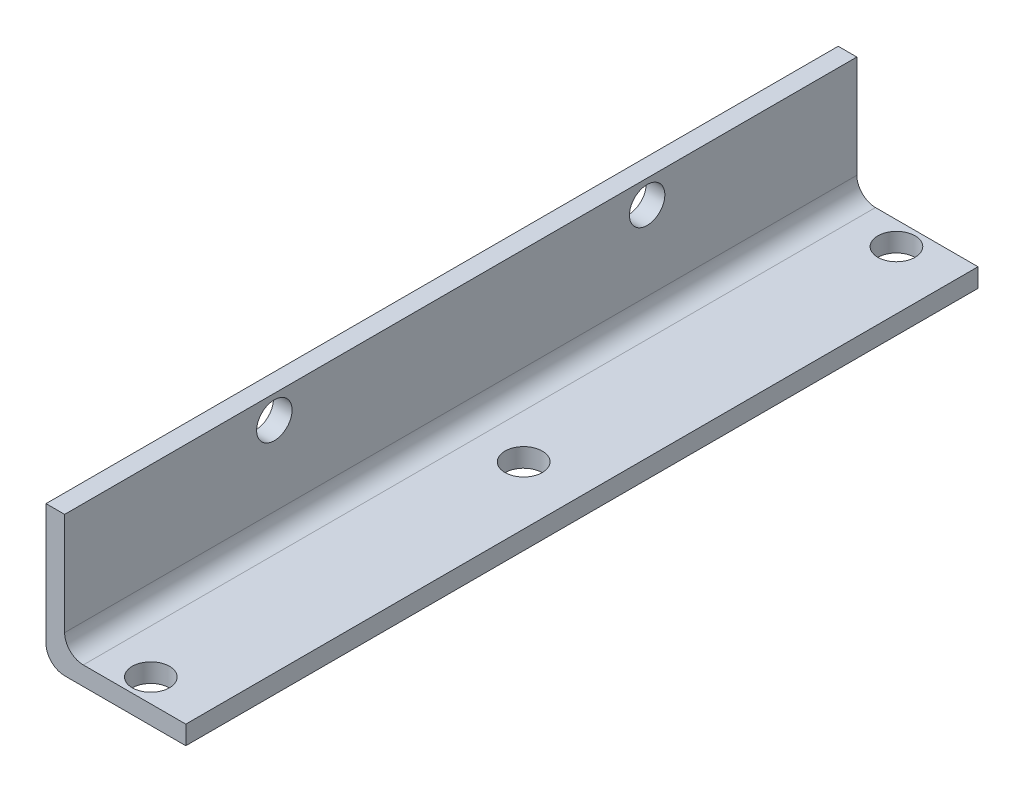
from build123d import *

# Parameters (mm, degrees)
EXTRUDE1_DEPTH     = 107.95
SKETCH2_R          = 4.826
CUT_EXTRUDE1_DEPTH = 120.14332923
SKETCH3_R          = 5.08
CUT_EXTRUDE2_DEPTH = 120.135410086
LPATTERN1_COUNT    = 2
LPATTERN1_PITCH    = 101.6
LPATTERN2_COUNT    = 2
LPATTERN2_PITCH    = 101.6


with BuildPart() as part:
    # Sketch1 → Extrude1 (new, symmetric)
    with BuildSketch(Plane.XY):
        with BuildLine():
            Line((0, 38.1), (0, 5.08))
            ThreePointArc((0, 5.08), (1.487897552, 1.487897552), (5.08, 0))
            Line((5.08, 0), (38.1, 0))
            Line((38.1, 0), (38.1, 5.108585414))
            Line((38.1, 5.108585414), (10.16, 5.108585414))
            ThreePointArc((10.16, 5.108585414), (6.567897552, 6.596482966), (5.08, 10.188585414))
            Line((5.08, 10.188585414), (5.08, 38.1))
            Line((5.08, 38.1), (0, 38.1))
        make_face()
    extrude(amount=EXTRUDE1_DEPTH, both=True)

    # Sketch2 → Cut-Extrude1 (cut, through all)
    with BuildSketch(Plane(origin=(5.08, 0, 0), x_dir=(0, 0, -1), z_dir=(1, 0, 0))):
        with Locations(Location((-50.8, 31.75, 0), (0, 0, 90))):
            Circle(SKETCH2_R)
    cut_extrude1 = extrude(amount=-CUT_EXTRUDE1_DEPTH, mode=Mode.SUBTRACT)

    # Mirror1: Cut-Extrude1 across plane
    add(cut_extrude1.mirror(Plane.XY), mode=Mode.SUBTRACT)

    # Sketch3 → Cut-Extrude2 (cut, through all)
    with BuildSketch(Plane(origin=(0, 5.108585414, 0), x_dir=(-1, 0, 0), z_dir=(0, 1, 0))):
        with Locations((-22.225, 0)):
            Circle(SKETCH3_R)
    cut_extrude2 = extrude(amount=-CUT_EXTRUDE2_DEPTH, mode=Mode.SUBTRACT)

    # LPattern1: Cut-Extrude2 ×2
    with Locations(*[(0, 0, -i * LPATTERN1_PITCH) for i in range(1, LPATTERN1_COUNT)]):
        add(cut_extrude2, mode=Mode.SUBTRACT)

    # LPattern2: Cut-Extrude2 ×2
    with Locations(*[(0, 0, i * LPATTERN2_PITCH) for i in range(1, LPATTERN2_COUNT)]):
        add(cut_extrude2, mode=Mode.SUBTRACT)


solid = part.part
